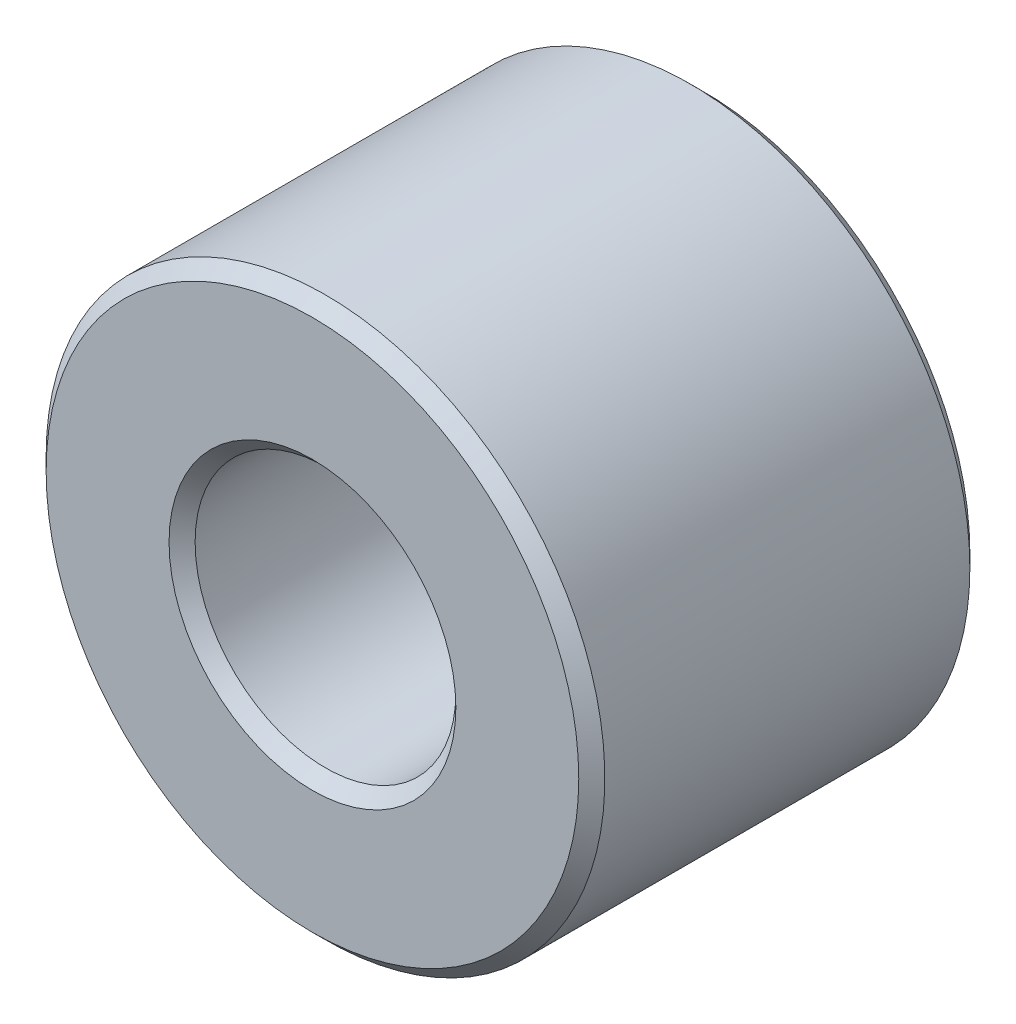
ISO-10303-21;
HEADER;
FILE_DESCRIPTION(('STEP AP214'),'2;1');
FILE_NAME('part.step','',(''),(''),'','','');
FILE_SCHEMA(('AUTOMOTIVE_DESIGN { 1 0 10303 214 1 1 1 1 }'));
ENDSEC;
DATA;
#1=APPLICATION_CONTEXT('core data for automotive mechanical design processes');
#2=APPLICATION_PROTOCOL_DEFINITION('international standard','automotive_design',2000,#1);
#3=PRODUCT_CONTEXT('',#1,'mechanical');
#4=PRODUCT('Part','Part','',(#3));
#5=PRODUCT_RELATED_PRODUCT_CATEGORY('part','',(#4));
#6=PRODUCT_DEFINITION_FORMATION('','',#4);
#7=PRODUCT_DEFINITION_CONTEXT('part definition',#1,'design');
#8=PRODUCT_DEFINITION('design','',#6,#7);
#9=PRODUCT_DEFINITION_SHAPE('','',#8);
#10=(LENGTH_UNIT() NAMED_UNIT(*) SI_UNIT(.MILLI.,.METRE.));
#11=(NAMED_UNIT(*) PLANE_ANGLE_UNIT() SI_UNIT($,.RADIAN.));
#12=(NAMED_UNIT(*) SI_UNIT($,.STERADIAN.) SOLID_ANGLE_UNIT());
#13=UNCERTAINTY_MEASURE_WITH_UNIT(LENGTH_MEASURE(1.E-05),#10,'distance_accuracy_value','');
#14=(GEOMETRIC_REPRESENTATION_CONTEXT(3) GLOBAL_UNCERTAINTY_ASSIGNED_CONTEXT((#13)) GLOBAL_UNIT_ASSIGNED_CONTEXT((#10,
#11,#12)) REPRESENTATION_CONTEXT('',''));
#15=CARTESIAN_POINT('',(0.,0.,0.));
#16=DIRECTION('',(0.,0.,1.));
#17=DIRECTION('',(1.,0.,0.));
#18=AXIS2_PLACEMENT_3D('',#15,#16,#17);
#19=CARTESIAN_POINT('',(0.,0.,10.5));
#20=DIRECTION('',(0.,0.,1.));
#21=DIRECTION('',(1.,0.,0.));
#22=AXIS2_PLACEMENT_3D('',#19,#20,#21);
#23=PLANE('',#22);
#24=CARTESIAN_POINT('',(0.,0.,10.5));
#25=DIRECTION('',(0.,0.,1.));
#26=DIRECTION('',(1.,0.,0.));
#27=AXIS2_PLACEMENT_3D('',#24,#25,#26);
#28=CIRCLE('',#27,7.70000000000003);
#29=CARTESIAN_POINT('',(7.70000000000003,0.,10.5));
#30=VERTEX_POINT('',#29);
#31=EDGE_CURVE('E10',#30,#30,#28,.F.);
#32=ORIENTED_EDGE('',*,*,#31,.T.);
#33=EDGE_LOOP('',(#32));
#34=FACE_BOUND('',#33,.T.);
#35=CARTESIAN_POINT('',(0.,0.,10.5));
#36=DIRECTION('',(0.,0.,1.));
#37=DIRECTION('',(1.,0.,0.));
#38=AXIS2_PLACEMENT_3D('',#35,#36,#37);
#39=CIRCLE('',#38,14.3);
#40=CARTESIAN_POINT('',(14.3,0.,10.5));
#41=VERTEX_POINT('',#40);
#42=EDGE_CURVE('E45',#41,#41,#39,.T.);
#43=ORIENTED_EDGE('',*,*,#42,.T.);
#44=EDGE_LOOP('',(#43));
#45=FACE_BOUND('',#44,.T.);
#46=ADVANCED_FACE('F37',(#34,#45),#23,.T.);
#47=CARTESIAN_POINT('',(0.,0.,-10.5));
#48=DIRECTION('',(0.,0.,1.));
#49=DIRECTION('',(1.,0.,0.));
#50=AXIS2_PLACEMENT_3D('',#47,#48,#49);
#51=PLANE('',#50);
#52=CARTESIAN_POINT('',(0.,0.,-10.5));
#53=DIRECTION('',(0.,0.,1.));
#54=DIRECTION('',(1.,0.,0.));
#55=AXIS2_PLACEMENT_3D('',#52,#53,#54);
#56=CIRCLE('',#55,7.69999999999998);
#57=CARTESIAN_POINT('',(7.69999999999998,0.,-10.5));
#58=VERTEX_POINT('',#57);
#59=EDGE_CURVE('E71',#58,#58,#56,.T.);
#60=ORIENTED_EDGE('',*,*,#59,.T.);
#61=EDGE_LOOP('',(#60));
#62=FACE_BOUND('',#61,.T.);
#63=CARTESIAN_POINT('',(0.,0.,-10.5));
#64=DIRECTION('',(0.,0.,1.));
#65=DIRECTION('',(1.,0.,0.));
#66=AXIS2_PLACEMENT_3D('',#63,#64,#65);
#67=CIRCLE('',#66,14.3);
#68=CARTESIAN_POINT('',(14.3,0.,-10.5));
#69=VERTEX_POINT('',#68);
#70=EDGE_CURVE('E74',#69,#69,#67,.F.);
#71=ORIENTED_EDGE('',*,*,#70,.T.);
#72=EDGE_LOOP('',(#71));
#73=FACE_BOUND('',#72,.T.);
#74=ADVANCED_FACE('F78',(#62,#73),#51,.F.);
#75=CARTESIAN_POINT('',(0.,0.,10.5));
#76=DIRECTION('',(0.,0.,-1.));
#77=DIRECTION('',(-1.,0.,0.));
#78=AXIS2_PLACEMENT_3D('',#75,#76,#77);
#79=CYLINDRICAL_SURFACE('',#78,15.);
#80=CARTESIAN_POINT('',(0.,0.,-9.79999999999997));
#81=DIRECTION('',(0.,0.,1.));
#82=DIRECTION('',(1.,0.,0.));
#83=AXIS2_PLACEMENT_3D('',#80,#81,#82);
#84=CIRCLE('',#83,15.);
#85=CARTESIAN_POINT('',(-15.,0.,-9.79999999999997));
#86=VERTEX_POINT('',#85);
#87=EDGE_CURVE('E52',#86,#86,#84,.T.);
#88=CARTESIAN_POINT('',(0.,0.,9.80000000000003));
#89=DIRECTION('',(0.,0.,1.));
#90=DIRECTION('',(1.,0.,0.));
#91=AXIS2_PLACEMENT_3D('',#88,#89,#90);
#92=CIRCLE('',#91,15.);
#93=CARTESIAN_POINT('',(-15.,0.,9.80000000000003));
#94=VERTEX_POINT('',#93);
#95=EDGE_CURVE('E58',#94,#94,#92,.F.);
#96=CARTESIAN_POINT('',(-15.,0.,-9.79999999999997));
#97=CARTESIAN_POINT('',(-15.,0.,-9.59583333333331));
#98=CARTESIAN_POINT('',(-15.,0.,-9.39166666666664));
#99=CARTESIAN_POINT('',(-15.,0.,-8.98333333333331));
#100=CARTESIAN_POINT('',(-15.,0.,-8.77916666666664));
#101=CARTESIAN_POINT('',(-15.,0.,-8.37083333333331));
#102=CARTESIAN_POINT('',(-15.,0.,-8.16666666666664));
#103=CARTESIAN_POINT('',(-15.,0.,-7.75833333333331));
#104=CARTESIAN_POINT('',(-15.,0.,-7.55416666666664));
#105=CARTESIAN_POINT('',(-15.,0.,-7.14583333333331));
#106=CARTESIAN_POINT('',(-15.,0.,-6.94166666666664));
#107=CARTESIAN_POINT('',(-15.,0.,-6.5333333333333));
#108=CARTESIAN_POINT('',(-15.,0.,-6.32916666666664));
#109=CARTESIAN_POINT('',(-15.,0.,-5.92083333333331));
#110=CARTESIAN_POINT('',(-15.,0.,-5.71666666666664));
#111=CARTESIAN_POINT('',(-15.,0.,-5.30833333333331));
#112=CARTESIAN_POINT('',(-15.,0.,-5.10416666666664));
#113=CARTESIAN_POINT('',(-15.,0.,-4.69583333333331));
#114=CARTESIAN_POINT('',(-15.,0.,-4.49166666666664));
#115=CARTESIAN_POINT('',(-15.,0.,-4.08333333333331));
#116=CARTESIAN_POINT('',(-15.,0.,-3.87916666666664));
#117=CARTESIAN_POINT('',(-15.,0.,-3.47083333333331));
#118=CARTESIAN_POINT('',(-15.,0.,-3.26666666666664));
#119=CARTESIAN_POINT('',(-15.,0.,-2.85833333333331));
#120=CARTESIAN_POINT('',(-15.,0.,-2.65416666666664));
#121=CARTESIAN_POINT('',(-15.,0.,-2.24583333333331));
#122=CARTESIAN_POINT('',(-15.,0.,-2.04166666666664));
#123=CARTESIAN_POINT('',(-15.,0.,-1.63333333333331));
#124=CARTESIAN_POINT('',(-15.,0.,-1.42916666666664));
#125=CARTESIAN_POINT('',(-15.,0.,-1.02083333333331));
#126=CARTESIAN_POINT('',(-15.,0.,-0.816666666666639));
#127=CARTESIAN_POINT('',(-15.,0.,-0.408333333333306));
#128=CARTESIAN_POINT('',(-15.,0.,-0.204166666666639));
#129=CARTESIAN_POINT('',(-15.,0.,0.204166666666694));
#130=CARTESIAN_POINT('',(-15.,0.,0.408333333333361));
#131=CARTESIAN_POINT('',(-15.,0.,0.816666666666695));
#132=CARTESIAN_POINT('',(-15.,0.,1.02083333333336));
#133=CARTESIAN_POINT('',(-15.,0.,1.42916666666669));
#134=CARTESIAN_POINT('',(-15.,0.,1.63333333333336));
#135=CARTESIAN_POINT('',(-15.,0.,2.04166666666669));
#136=CARTESIAN_POINT('',(-15.,0.,2.24583333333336));
#137=CARTESIAN_POINT('',(-15.,0.,2.65416666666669));
#138=CARTESIAN_POINT('',(-15.,0.,2.85833333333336));
#139=CARTESIAN_POINT('',(-15.,0.,3.26666666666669));
#140=CARTESIAN_POINT('',(-15.,0.,3.47083333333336));
#141=CARTESIAN_POINT('',(-15.,0.,3.87916666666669));
#142=CARTESIAN_POINT('',(-15.,0.,4.08333333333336));
#143=CARTESIAN_POINT('',(-15.,0.,4.49166666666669));
#144=CARTESIAN_POINT('',(-15.,0.,4.69583333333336));
#145=CARTESIAN_POINT('',(-15.,0.,5.1041666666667));
#146=CARTESIAN_POINT('',(-15.,0.,5.30833333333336));
#147=CARTESIAN_POINT('',(-15.,0.,5.7166666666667));
#148=CARTESIAN_POINT('',(-15.,0.,5.92083333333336));
#149=CARTESIAN_POINT('',(-15.,0.,6.3291666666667));
#150=CARTESIAN_POINT('',(-15.,0.,6.53333333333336));
#151=CARTESIAN_POINT('',(-15.,0.,6.94166666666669));
#152=CARTESIAN_POINT('',(-15.,0.,7.14583333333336));
#153=CARTESIAN_POINT('',(-15.,0.,7.5541666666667));
#154=CARTESIAN_POINT('',(-15.,0.,7.75833333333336));
#155=CARTESIAN_POINT('',(-15.,0.,8.1666666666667));
#156=CARTESIAN_POINT('',(-15.,0.,8.37083333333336));
#157=CARTESIAN_POINT('',(-15.,0.,8.7791666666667));
#158=CARTESIAN_POINT('',(-15.,0.,8.98333333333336));
#159=CARTESIAN_POINT('',(-15.,0.,9.39166666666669));
#160=CARTESIAN_POINT('',(-15.,0.,9.59583333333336));
#161=CARTESIAN_POINT('',(-15.,0.,9.80000000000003));
#162=B_SPLINE_CURVE_WITH_KNOTS('',3,(#96,#97,#98,#99,#100,#101,#102,#103,#104,#105,#106,#107,
#108,#109,#110,#111,#112,#113,#114,#115,#116,#117,#118,#119,#120,#121,#122,#123,#124,#125,#126,
#127,#128,#129,#130,#131,#132,#133,#134,#135,#136,#137,#138,#139,#140,#141,#142,#143,#144,#145,
#146,#147,#148,#149,#150,#151,#152,#153,#154,#155,#156,#157,#158,#159,#160,#161),.UNSPECIFIED.,
.F.,.F.,(4,2,2,2,2,2,2,2,2,2,2,2,2,2,2,2,2,2,2,2,2,2,2,2,2,2,2,2,2,2,2,2,4),(0.,
0.612500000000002,1.225,1.8375,2.45,3.0625,3.675,4.2875,4.9,5.5125,6.125,6.7375,7.35,7.9625,
8.575,9.1875,9.8,10.4125,11.025,11.6375,12.25,12.8625,13.475,14.0875,14.7,15.3125,15.925,
16.5375,17.15,17.7625,18.375,18.9875,19.6),.UNSPECIFIED.);
#163=EDGE_CURVE('BSEAM88',#86,#94,#162,.T.);
#164=ORIENTED_EDGE('',*,*,#87,.T.);
#165=ORIENTED_EDGE('',*,*,#95,.T.);
#166=ORIENTED_EDGE('',*,*,#163,.T.);
#167=ORIENTED_EDGE('',*,*,#163,.F.);
#168=EDGE_LOOP('',(#164,#166,#165,#167));
#169=FACE_BOUND('',#168,.T.);
#170=ADVANCED_FACE('F88',(#169),#79,.T.);
#171=CARTESIAN_POINT('',(0.,0.,10.5));
#172=DIRECTION('',(0.,0.,-1.));
#173=DIRECTION('',(-1.,0.,0.));
#174=AXIS2_PLACEMENT_3D('',#171,#172,#173);
#175=CYLINDRICAL_SURFACE('',#174,7.);
#176=CARTESIAN_POINT('',(0.,0.,-9.80000000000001));
#177=DIRECTION('',(0.,0.,1.));
#178=DIRECTION('',(1.,0.,0.));
#179=AXIS2_PLACEMENT_3D('',#176,#177,#178);
#180=CIRCLE('',#179,7.);
#181=CARTESIAN_POINT('',(-7.,0.,-9.80000000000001));
#182=VERTEX_POINT('',#181);
#183=EDGE_CURVE('E64',#182,#182,#180,.F.);
#184=CARTESIAN_POINT('',(0.,0.,9.79999999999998));
#185=DIRECTION('',(0.,0.,1.));
#186=DIRECTION('',(1.,0.,0.));
#187=AXIS2_PLACEMENT_3D('',#184,#185,#186);
#188=CIRCLE('',#187,7.);
#189=CARTESIAN_POINT('',(-7.,0.,9.79999999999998));
#190=VERTEX_POINT('',#189);
#191=EDGE_CURVE('E67',#190,#190,#188,.T.);
#192=CARTESIAN_POINT('',(-7.,0.,-9.80000000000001));
#193=CARTESIAN_POINT('',(-7.,0.,-9.59583333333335));
#194=CARTESIAN_POINT('',(-7.,0.,-9.39166666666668));
#195=CARTESIAN_POINT('',(-7.,0.,-8.98333333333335));
#196=CARTESIAN_POINT('',(-7.,0.,-8.77916666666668));
#197=CARTESIAN_POINT('',(-7.,0.,-8.37083333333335));
#198=CARTESIAN_POINT('',(-7.,0.,-8.16666666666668));
#199=CARTESIAN_POINT('',(-7.,0.,-7.75833333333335));
#200=CARTESIAN_POINT('',(-7.,0.,-7.55416666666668));
#201=CARTESIAN_POINT('',(-7.,0.,-7.14583333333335));
#202=CARTESIAN_POINT('',(-7.,0.,-6.94166666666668));
#203=CARTESIAN_POINT('',(-7.,0.,-6.53333333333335));
#204=CARTESIAN_POINT('',(-7.,0.,-6.32916666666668));
#205=CARTESIAN_POINT('',(-7.,0.,-5.92083333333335));
#206=CARTESIAN_POINT('',(-7.,0.,-5.71666666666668));
#207=CARTESIAN_POINT('',(-7.,0.,-5.30833333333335));
#208=CARTESIAN_POINT('',(-7.,0.,-5.10416666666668));
#209=CARTESIAN_POINT('',(-7.,0.,-4.69583333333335));
#210=CARTESIAN_POINT('',(-7.,0.,-4.49166666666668));
#211=CARTESIAN_POINT('',(-7.,0.,-4.08333333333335));
#212=CARTESIAN_POINT('',(-7.,0.,-3.87916666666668));
#213=CARTESIAN_POINT('',(-7.,0.,-3.47083333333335));
#214=CARTESIAN_POINT('',(-7.,0.,-3.26666666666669));
#215=CARTESIAN_POINT('',(-7.,0.,-2.85833333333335));
#216=CARTESIAN_POINT('',(-7.,0.,-2.65416666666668));
#217=CARTESIAN_POINT('',(-7.,0.,-2.24583333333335));
#218=CARTESIAN_POINT('',(-7.,0.,-2.04166666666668));
#219=CARTESIAN_POINT('',(-7.,0.,-1.63333333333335));
#220=CARTESIAN_POINT('',(-7.,0.,-1.42916666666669));
#221=CARTESIAN_POINT('',(-7.,0.,-1.02083333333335));
#222=CARTESIAN_POINT('',(-7.,0.,-0.816666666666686));
#223=CARTESIAN_POINT('',(-7.,0.,-0.408333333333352));
#224=CARTESIAN_POINT('',(-7.,0.,-0.204166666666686));
#225=CARTESIAN_POINT('',(-7.,0.,0.204166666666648));
#226=CARTESIAN_POINT('',(-7.,0.,0.408333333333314));
#227=CARTESIAN_POINT('',(-7.,0.,0.816666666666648));
#228=CARTESIAN_POINT('',(-7.,0.,1.02083333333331));
#229=CARTESIAN_POINT('',(-7.,0.,1.42916666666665));
#230=CARTESIAN_POINT('',(-7.,0.,1.63333333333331));
#231=CARTESIAN_POINT('',(-7.,0.,2.04166666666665));
#232=CARTESIAN_POINT('',(-7.,0.,2.24583333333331));
#233=CARTESIAN_POINT('',(-7.,0.,2.65416666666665));
#234=CARTESIAN_POINT('',(-7.,0.,2.85833333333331));
#235=CARTESIAN_POINT('',(-7.,0.,3.26666666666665));
#236=CARTESIAN_POINT('',(-7.,0.,3.47083333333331));
#237=CARTESIAN_POINT('',(-7.,0.,3.87916666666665));
#238=CARTESIAN_POINT('',(-7.,0.,4.08333333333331));
#239=CARTESIAN_POINT('',(-7.,0.,4.49166666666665));
#240=CARTESIAN_POINT('',(-7.,0.,4.69583333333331));
#241=CARTESIAN_POINT('',(-7.,0.,5.10416666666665));
#242=CARTESIAN_POINT('',(-7.,0.,5.30833333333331));
#243=CARTESIAN_POINT('',(-7.,0.,5.71666666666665));
#244=CARTESIAN_POINT('',(-7.,0.,5.92083333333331));
#245=CARTESIAN_POINT('',(-7.,0.,6.32916666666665));
#246=CARTESIAN_POINT('',(-7.,0.,6.53333333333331));
#247=CARTESIAN_POINT('',(-7.,0.,6.94166666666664));
#248=CARTESIAN_POINT('',(-7.,0.,7.14583333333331));
#249=CARTESIAN_POINT('',(-7.,0.,7.55416666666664));
#250=CARTESIAN_POINT('',(-7.,0.,7.75833333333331));
#251=CARTESIAN_POINT('',(-7.,0.,8.16666666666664));
#252=CARTESIAN_POINT('',(-7.,0.,8.37083333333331));
#253=CARTESIAN_POINT('',(-7.,0.,8.77916666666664));
#254=CARTESIAN_POINT('',(-7.,0.,8.98333333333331));
#255=CARTESIAN_POINT('',(-7.,0.,9.39166666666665));
#256=CARTESIAN_POINT('',(-7.,0.,9.59583333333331));
#257=CARTESIAN_POINT('',(-7.,0.,9.79999999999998));
#258=B_SPLINE_CURVE_WITH_KNOTS('',3,(#192,#193,#194,#195,#196,#197,#198,#199,#200,#201,#202,
#203,#204,#205,#206,#207,#208,#209,#210,#211,#212,#213,#214,#215,#216,#217,#218,#219,#220,#221,
#222,#223,#224,#225,#226,#227,#228,#229,#230,#231,#232,#233,#234,#235,#236,#237,#238,#239,#240,
#241,#242,#243,#244,#245,#246,#247,#248,#249,#250,#251,#252,#253,#254,#255,#256,#257),
.UNSPECIFIED.,.F.,.F.,(4,2,2,2,2,2,2,2,2,2,2,2,2,2,2,2,2,2,2,2,2,2,2,2,2,2,2,2,2,2,2,2,4),(0.,
0.612499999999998,1.225,1.8375,2.45,3.0625,3.675,4.2875,4.9,5.5125,6.125,6.7375,7.35,7.9625,
8.575,9.1875,9.8,10.4125,11.025,11.6375,12.25,12.8625,13.475,14.0875,14.7,15.3125,15.925,
16.5375,17.15,17.7625,18.375,18.9875,19.6),.UNSPECIFIED.);
#259=EDGE_CURVE('BSEAM91',#182,#190,#258,.T.);
#260=ORIENTED_EDGE('',*,*,#183,.T.);
#261=ORIENTED_EDGE('',*,*,#191,.T.);
#262=ORIENTED_EDGE('',*,*,#259,.T.);
#263=ORIENTED_EDGE('',*,*,#259,.F.);
#264=EDGE_LOOP('',(#260,#262,#261,#263));
#265=FACE_BOUND('',#264,.T.);
#266=ADVANCED_FACE('F91',(#265),#175,.F.);
#267=CARTESIAN_POINT('',(0.,0.,-10.5));
#268=DIRECTION('',(0.,0.,-1.));
#269=DIRECTION('',(-1.,0.,0.));
#270=AXIS2_PLACEMENT_3D('',#267,#268,#269);
#271=CONICAL_SURFACE('',#270,7.69999999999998,0.785398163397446);
#272=ORIENTED_EDGE('',*,*,#183,.F.);
#273=EDGE_LOOP('',(#272));
#274=FACE_BOUND('',#273,.T.);
#275=ORIENTED_EDGE('',*,*,#59,.F.);
#276=EDGE_LOOP('',(#275));
#277=FACE_BOUND('',#276,.T.);
#278=ADVANCED_FACE('F84',(#274,#277),#271,.F.);
#279=CARTESIAN_POINT('',(0.,0.,-9.79999999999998));
#280=DIRECTION('',(0.,0.,1.));
#281=DIRECTION('',(1.,0.,0.));
#282=AXIS2_PLACEMENT_3D('',#279,#280,#281);
#283=CONICAL_SURFACE('',#282,15.,0.785398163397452);
#284=ORIENTED_EDGE('',*,*,#70,.F.);
#285=EDGE_LOOP('',(#284));
#286=FACE_BOUND('',#285,.T.);
#287=ORIENTED_EDGE('',*,*,#87,.F.);
#288=EDGE_LOOP('',(#287));
#289=FACE_BOUND('',#288,.T.);
#290=ADVANCED_FACE('F80',(#286,#289),#283,.T.);
#291=CARTESIAN_POINT('',(0.,0.,9.79999999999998));
#292=DIRECTION('',(0.,0.,1.));
#293=DIRECTION('',(1.,0.,0.));
#294=AXIS2_PLACEMENT_3D('',#291,#292,#293);
#295=CONICAL_SURFACE('',#294,7.,0.785398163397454);
#296=ORIENTED_EDGE('',*,*,#31,.F.);
#297=EDGE_LOOP('',(#296));
#298=FACE_BOUND('',#297,.T.);
#299=ORIENTED_EDGE('',*,*,#191,.F.);
#300=EDGE_LOOP('',(#299));
#301=FACE_BOUND('',#300,.T.);
#302=ADVANCED_FACE('F83',(#298,#301),#295,.F.);
#303=CARTESIAN_POINT('',(0.,0.,10.5));
#304=DIRECTION('',(0.,0.,-1.));
#305=DIRECTION('',(-1.,0.,0.));
#306=AXIS2_PLACEMENT_3D('',#303,#304,#305);
#307=CONICAL_SURFACE('',#306,14.3,0.785398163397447);
#308=ORIENTED_EDGE('',*,*,#95,.F.);
#309=EDGE_LOOP('',(#308));
#310=FACE_BOUND('',#309,.T.);
#311=ORIENTED_EDGE('',*,*,#42,.F.);
#312=EDGE_LOOP('',(#311));
#313=FACE_BOUND('',#312,.T.);
#314=ADVANCED_FACE('F39',(#310,#313),#307,.T.);
#315=CLOSED_SHELL('',(#46,#74,#170,#266,#278,#290,#302,#314));
#316=MANIFOLD_SOLID_BREP('B2',#315);
#317=ADVANCED_BREP_SHAPE_REPRESENTATION('',(#18,#316),#14);
#318=SHAPE_DEFINITION_REPRESENTATION(#9,#317);
ENDSEC;
END-ISO-10303-21;
